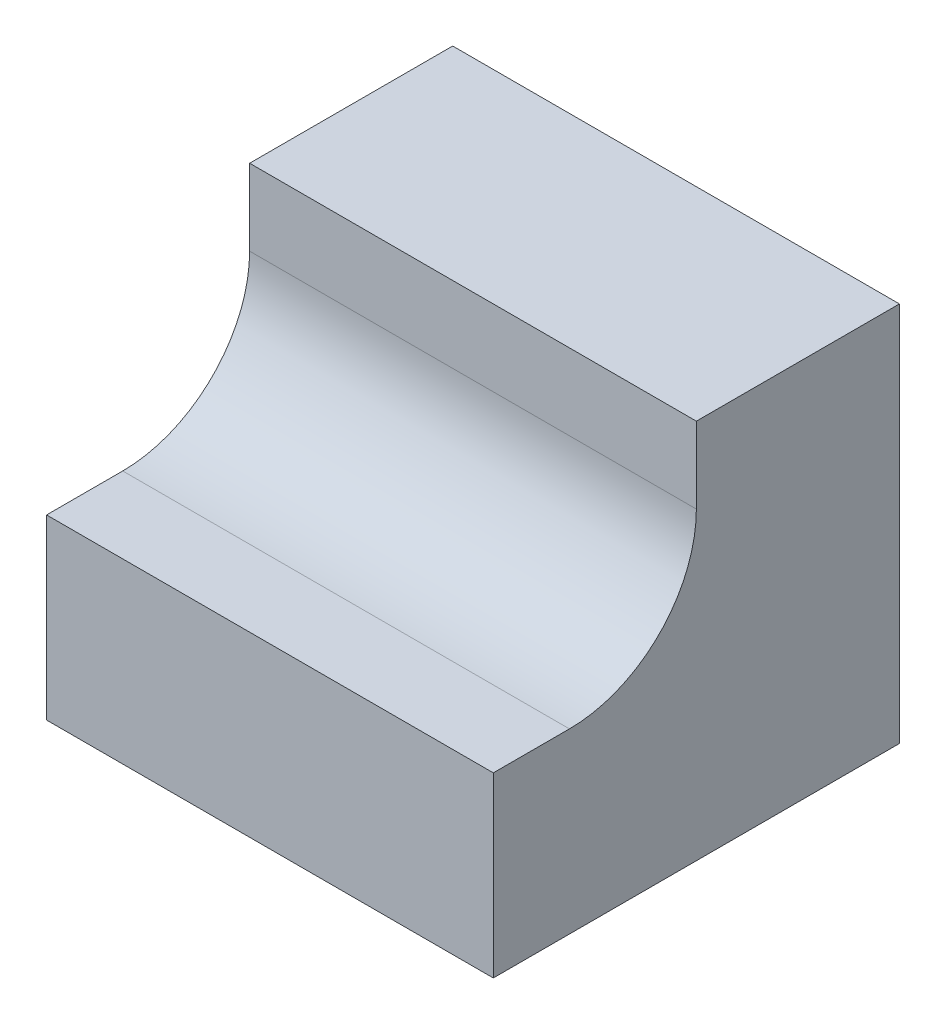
from build123d import *

# Parameters (mm, degrees)
SKETCH1_W           = 88
SKETCH1_H           = 75
BOSS_EXTRUDE1_DEPTH = 80
SKETCH3_W           = 40
SKETCH3_H           = 40
CUT_EXTRUDE1_DEPTH  = 141.602275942
SYMMETRIC_R         = 25


with BuildPart() as part:
    # Sketch1 → Boss-Extrude1 (new body)
    with BuildSketch(Plane.XY):
        with Locations((44, 37.5)):
            Rectangle(SKETCH1_W, SKETCH1_H)
    extrude(amount=BOSS_EXTRUDE1_DEPTH)

    # Sketch3 → Cut-Extrude1 (cut, through all)
    with BuildSketch(Plane(origin=(88, 0, 0), x_dir=(0, 0, -1), z_dir=(1, 0, 0))):
        with Locations((-60, 55)):
            Rectangle(SKETCH3_W, SKETCH3_H)
    extrude(amount=-CUT_EXTRUDE1_DEPTH, mode=Mode.SUBTRACT)

    # Symmetric
    symmetric_edges = [part.edges().sort_by_distance(p)[0] for p in [
        (44, 35, 40),
    ]]
    fillet(symmetric_edges, radius=SYMMETRIC_R)


solid = part.part
